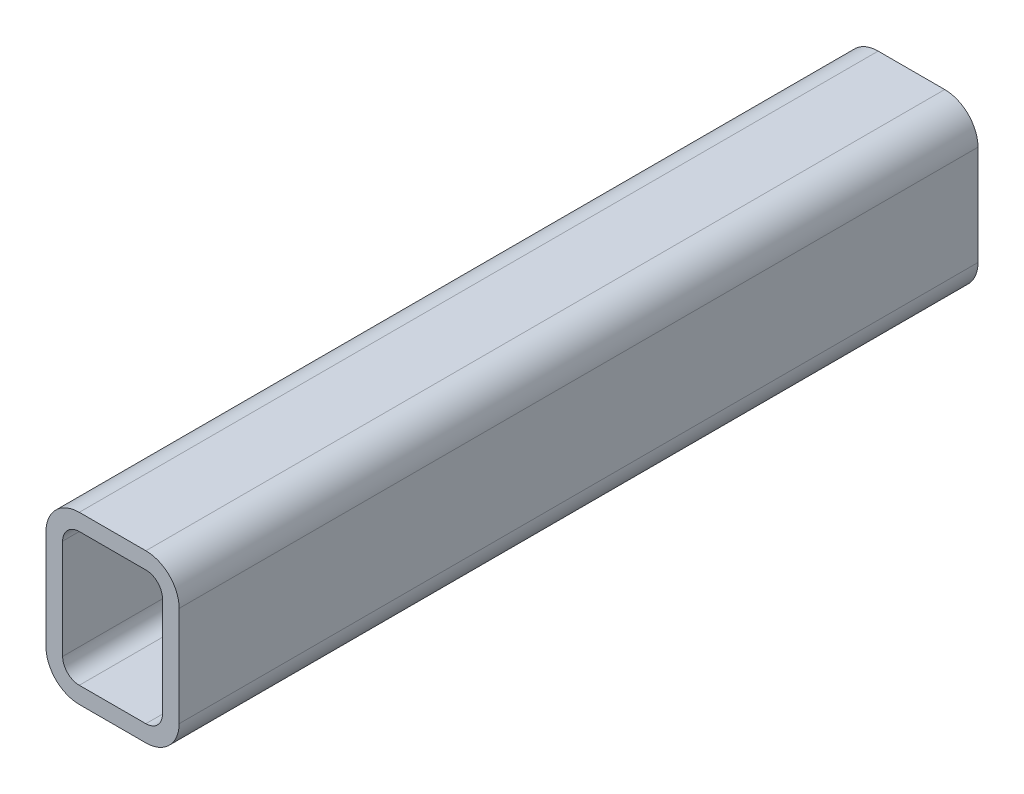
ISO-10303-21;
HEADER;
FILE_DESCRIPTION(('STEP AP214'),'2;1');
FILE_NAME('part.step','',(''),(''),'','','');
FILE_SCHEMA(('AUTOMOTIVE_DESIGN { 1 0 10303 214 1 1 1 1 }'));
ENDSEC;
DATA;
#1=APPLICATION_CONTEXT('core data for automotive mechanical design processes');
#2=APPLICATION_PROTOCOL_DEFINITION('international standard','automotive_design',2000,#1);
#3=PRODUCT_CONTEXT('',#1,'mechanical');
#4=PRODUCT('Part','Part','',(#3));
#5=PRODUCT_RELATED_PRODUCT_CATEGORY('part','',(#4));
#6=PRODUCT_DEFINITION_FORMATION('','',#4);
#7=PRODUCT_DEFINITION_CONTEXT('part definition',#1,'design');
#8=PRODUCT_DEFINITION('design','',#6,#7);
#9=PRODUCT_DEFINITION_SHAPE('','',#8);
#10=(LENGTH_UNIT() NAMED_UNIT(*) SI_UNIT(.MILLI.,.METRE.));
#11=(NAMED_UNIT(*) PLANE_ANGLE_UNIT() SI_UNIT($,.RADIAN.));
#12=(NAMED_UNIT(*) SI_UNIT($,.STERADIAN.) SOLID_ANGLE_UNIT());
#13=UNCERTAINTY_MEASURE_WITH_UNIT(LENGTH_MEASURE(1.E-05),#10,'distance_accuracy_value','');
#14=(GEOMETRIC_REPRESENTATION_CONTEXT(3) GLOBAL_UNCERTAINTY_ASSIGNED_CONTEXT((#13)) GLOBAL_UNIT_ASSIGNED_CONTEXT((#10,
#11,#12)) REPRESENTATION_CONTEXT('',''));
#15=CARTESIAN_POINT('',(0.,0.,0.));
#16=DIRECTION('',(0.,0.,1.));
#17=DIRECTION('',(1.,0.,0.));
#18=AXIS2_PLACEMENT_3D('',#15,#16,#17);
#19=CARTESIAN_POINT('',(12.7,50.8,304.8));
#20=DIRECTION('',(0.,0.,1.));
#21=DIRECTION('',(1.,0.,0.));
#22=AXIS2_PLACEMENT_3D('',#19,#20,#21);
#23=PLANE('',#22);
#24=CARTESIAN_POINT('',(12.7,50.8,304.8));
#25=DIRECTION('',(0.,0.,1.));
#26=DIRECTION('',(1.,0.,0.));
#27=AXIS2_PLACEMENT_3D('',#24,#25,#26);
#28=CIRCLE('',#27,12.7);
#29=CARTESIAN_POINT('',(12.7,63.5,304.8));
#30=VERTEX_POINT('',#29);
#31=CARTESIAN_POINT('',(0.,50.8,304.8));
#32=VERTEX_POINT('',#31);
#33=EDGE_CURVE('E211',#30,#32,#28,.T.);
#34=ORIENTED_EDGE('',*,*,#33,.T.);
#35=DIRECTION('',(0.,-1.,0.));
#36=VECTOR('',#35,1.);
#37=CARTESIAN_POINT('',(0.,12.7,304.8));
#38=LINE('',#37,#36);
#39=CARTESIAN_POINT('',(0.,12.7,304.8));
#40=VERTEX_POINT('',#39);
#41=EDGE_CURVE('E214',#32,#40,#38,.T.);
#42=ORIENTED_EDGE('',*,*,#41,.T.);
#43=CARTESIAN_POINT('',(12.7,12.7,304.8));
#44=DIRECTION('',(0.,0.,1.));
#45=DIRECTION('',(1.,0.,0.));
#46=AXIS2_PLACEMENT_3D('',#43,#44,#45);
#47=CIRCLE('',#46,12.7);
#48=CARTESIAN_POINT('',(12.7,0.,304.8));
#49=VERTEX_POINT('',#48);
#50=EDGE_CURVE('E217',#40,#49,#47,.T.);
#51=ORIENTED_EDGE('',*,*,#50,.T.);
#52=DIRECTION('',(1.,0.,0.));
#53=VECTOR('',#52,1.);
#54=CARTESIAN_POINT('',(38.1,0.,304.8));
#55=LINE('',#54,#53);
#56=CARTESIAN_POINT('',(38.1,0.,304.8));
#57=VERTEX_POINT('',#56);
#58=EDGE_CURVE('E219',#49,#57,#55,.T.);
#59=ORIENTED_EDGE('',*,*,#58,.T.);
#60=CARTESIAN_POINT('',(38.1,12.7,304.8));
#61=DIRECTION('',(0.,0.,1.));
#62=DIRECTION('',(1.,0.,0.));
#63=AXIS2_PLACEMENT_3D('',#60,#61,#62);
#64=CIRCLE('',#63,12.7);
#65=CARTESIAN_POINT('',(50.8,12.7,304.8));
#66=VERTEX_POINT('',#65);
#67=EDGE_CURVE('E221',#57,#66,#64,.T.);
#68=ORIENTED_EDGE('',*,*,#67,.T.);
#69=DIRECTION('',(0.,1.,0.));
#70=VECTOR('',#69,1.);
#71=CARTESIAN_POINT('',(50.8,50.8,304.8));
#72=LINE('',#71,#70);
#73=CARTESIAN_POINT('',(50.8,50.8,304.8));
#74=VERTEX_POINT('',#73);
#75=EDGE_CURVE('E223',#66,#74,#72,.T.);
#76=ORIENTED_EDGE('',*,*,#75,.T.);
#77=CARTESIAN_POINT('',(38.1,50.8,304.8));
#78=DIRECTION('',(0.,0.,1.));
#79=DIRECTION('',(1.,0.,0.));
#80=AXIS2_PLACEMENT_3D('',#77,#78,#79);
#81=CIRCLE('',#80,12.7);
#82=CARTESIAN_POINT('',(38.1,63.5,304.8));
#83=VERTEX_POINT('',#82);
#84=EDGE_CURVE('E225',#74,#83,#81,.T.);
#85=ORIENTED_EDGE('',*,*,#84,.T.);
#86=DIRECTION('',(-1.,0.,0.));
#87=VECTOR('',#86,1.);
#88=CARTESIAN_POINT('',(12.7,63.5,304.8));
#89=LINE('',#88,#87);
#90=EDGE_CURVE('E227',#83,#30,#89,.T.);
#91=ORIENTED_EDGE('',*,*,#90,.T.);
#92=EDGE_LOOP('',(#34,#42,#51,#59,#68,#76,#85,#91));
#93=FACE_BOUND('',#92,.T.);
#94=DIRECTION('',(0.,-1.,0.));
#95=VECTOR('',#94,1.);
#96=CARTESIAN_POINT('',(6.35,12.7,304.8));
#97=LINE('',#96,#95);
#98=CARTESIAN_POINT('',(6.35,50.8,304.8));
#99=VERTEX_POINT('',#98);
#100=CARTESIAN_POINT('',(6.35,12.7,304.8));
#101=VERTEX_POINT('',#100);
#102=EDGE_CURVE('E154',#99,#101,#97,.T.);
#103=ORIENTED_EDGE('',*,*,#102,.F.);
#104=CARTESIAN_POINT('',(12.7,50.8,304.8));
#105=DIRECTION('',(0.,0.,1.));
#106=DIRECTION('',(1.,0.,0.));
#107=AXIS2_PLACEMENT_3D('',#104,#105,#106);
#108=CIRCLE('',#107,6.35);
#109=CARTESIAN_POINT('',(12.7,57.15,304.8));
#110=VERTEX_POINT('',#109);
#111=EDGE_CURVE('E146',#110,#99,#108,.T.);
#112=ORIENTED_EDGE('',*,*,#111,.F.);
#113=DIRECTION('',(-1.,0.,0.));
#114=VECTOR('',#113,1.);
#115=CARTESIAN_POINT('',(12.7,57.15,304.8));
#116=LINE('',#115,#114);
#117=CARTESIAN_POINT('',(38.1,57.15,304.8));
#118=VERTEX_POINT('',#117);
#119=EDGE_CURVE('E179',#118,#110,#116,.T.);
#120=ORIENTED_EDGE('',*,*,#119,.F.);
#121=CARTESIAN_POINT('',(38.1,50.8,304.8));
#122=DIRECTION('',(0.,0.,1.));
#123=DIRECTION('',(1.,0.,0.));
#124=AXIS2_PLACEMENT_3D('',#121,#122,#123);
#125=CIRCLE('',#124,6.35);
#126=CARTESIAN_POINT('',(44.45,50.8,304.8));
#127=VERTEX_POINT('',#126);
#128=EDGE_CURVE('E177',#127,#118,#125,.T.);
#129=ORIENTED_EDGE('',*,*,#128,.F.);
#130=DIRECTION('',(0.,1.,0.));
#131=VECTOR('',#130,1.);
#132=CARTESIAN_POINT('',(44.45,50.8,304.8));
#133=LINE('',#132,#131);
#134=CARTESIAN_POINT('',(44.45,12.7,304.8));
#135=VERTEX_POINT('',#134);
#136=EDGE_CURVE('E175',#135,#127,#133,.T.);
#137=ORIENTED_EDGE('',*,*,#136,.F.);
#138=CARTESIAN_POINT('',(38.1,12.7,304.8));
#139=DIRECTION('',(0.,0.,1.));
#140=DIRECTION('',(1.,0.,0.));
#141=AXIS2_PLACEMENT_3D('',#138,#139,#140);
#142=CIRCLE('',#141,6.35);
#143=CARTESIAN_POINT('',(38.1,6.35,304.8));
#144=VERTEX_POINT('',#143);
#145=EDGE_CURVE('E173',#144,#135,#142,.T.);
#146=ORIENTED_EDGE('',*,*,#145,.F.);
#147=DIRECTION('',(1.,0.,0.));
#148=VECTOR('',#147,1.);
#149=CARTESIAN_POINT('',(38.1,6.35,304.8));
#150=LINE('',#149,#148);
#151=CARTESIAN_POINT('',(12.7,6.35,304.8));
#152=VERTEX_POINT('',#151);
#153=EDGE_CURVE('E169',#152,#144,#150,.T.);
#154=ORIENTED_EDGE('',*,*,#153,.F.);
#155=CARTESIAN_POINT('',(12.7,12.7,304.8));
#156=DIRECTION('',(0.,0.,1.));
#157=DIRECTION('',(1.,0.,0.));
#158=AXIS2_PLACEMENT_3D('',#155,#156,#157);
#159=CIRCLE('',#158,6.35);
#160=EDGE_CURVE('E167',#101,#152,#159,.T.);
#161=ORIENTED_EDGE('',*,*,#160,.F.);
#162=EDGE_LOOP('',(#103,#112,#120,#129,#137,#146,#154,#161));
#163=FACE_BOUND('',#162,.T.);
#164=ADVANCED_FACE('F33',(#93,#163),#23,.T.);
#165=CARTESIAN_POINT('',(12.7,50.8,0.));
#166=DIRECTION('',(0.,0.,1.));
#167=DIRECTION('',(1.,0.,0.));
#168=AXIS2_PLACEMENT_3D('',#165,#166,#167);
#169=PLANE('',#168);
#170=CARTESIAN_POINT('',(12.7,50.8,0.));
#171=DIRECTION('',(0.,0.,1.));
#172=DIRECTION('',(1.,0.,0.));
#173=AXIS2_PLACEMENT_3D('',#170,#171,#172);
#174=CIRCLE('',#173,12.7);
#175=CARTESIAN_POINT('',(12.7,63.5,0.));
#176=VERTEX_POINT('',#175);
#177=CARTESIAN_POINT('',(0.,50.8,0.));
#178=VERTEX_POINT('',#177);
#179=EDGE_CURVE('E162',#176,#178,#174,.T.);
#180=ORIENTED_EDGE('',*,*,#179,.F.);
#181=DIRECTION('',(-1.,0.,0.));
#182=VECTOR('',#181,1.);
#183=CARTESIAN_POINT('',(12.7,63.5,0.));
#184=LINE('',#183,#182);
#185=CARTESIAN_POINT('',(38.1,63.5,0.));
#186=VERTEX_POINT('',#185);
#187=EDGE_CURVE('E215',#186,#176,#184,.T.);
#188=ORIENTED_EDGE('',*,*,#187,.F.);
#189=CARTESIAN_POINT('',(38.1,50.8,0.));
#190=DIRECTION('',(0.,0.,1.));
#191=DIRECTION('',(1.,0.,0.));
#192=AXIS2_PLACEMENT_3D('',#189,#190,#191);
#193=CIRCLE('',#192,12.7);
#194=CARTESIAN_POINT('',(50.8,50.8,0.));
#195=VERTEX_POINT('',#194);
#196=EDGE_CURVE('E242',#195,#186,#193,.T.);
#197=ORIENTED_EDGE('',*,*,#196,.F.);
#198=DIRECTION('',(0.,1.,0.));
#199=VECTOR('',#198,1.);
#200=CARTESIAN_POINT('',(50.8,50.8,0.));
#201=LINE('',#200,#199);
#202=CARTESIAN_POINT('',(50.8,12.7,0.));
#203=VERTEX_POINT('',#202);
#204=EDGE_CURVE('E240',#203,#195,#201,.T.);
#205=ORIENTED_EDGE('',*,*,#204,.F.);
#206=CARTESIAN_POINT('',(38.1,12.7,0.));
#207=DIRECTION('',(0.,0.,1.));
#208=DIRECTION('',(1.,0.,0.));
#209=AXIS2_PLACEMENT_3D('',#206,#207,#208);
#210=CIRCLE('',#209,12.7);
#211=CARTESIAN_POINT('',(38.1,0.,0.));
#212=VERTEX_POINT('',#211);
#213=EDGE_CURVE('E238',#212,#203,#210,.T.);
#214=ORIENTED_EDGE('',*,*,#213,.F.);
#215=DIRECTION('',(1.,0.,0.));
#216=VECTOR('',#215,1.);
#217=CARTESIAN_POINT('',(38.1,0.,0.));
#218=LINE('',#217,#216);
#219=CARTESIAN_POINT('',(12.7,0.,0.));
#220=VERTEX_POINT('',#219);
#221=EDGE_CURVE('E236',#220,#212,#218,.T.);
#222=ORIENTED_EDGE('',*,*,#221,.F.);
#223=CARTESIAN_POINT('',(12.7,12.7,0.));
#224=DIRECTION('',(0.,0.,1.));
#225=DIRECTION('',(1.,0.,0.));
#226=AXIS2_PLACEMENT_3D('',#223,#224,#225);
#227=CIRCLE('',#226,12.7);
#228=CARTESIAN_POINT('',(0.,12.7,0.));
#229=VERTEX_POINT('',#228);
#230=EDGE_CURVE('E234',#229,#220,#227,.T.);
#231=ORIENTED_EDGE('',*,*,#230,.F.);
#232=DIRECTION('',(0.,-1.,0.));
#233=VECTOR('',#232,1.);
#234=CARTESIAN_POINT('',(0.,12.7,0.));
#235=LINE('',#234,#233);
#236=EDGE_CURVE('E232',#178,#229,#235,.T.);
#237=ORIENTED_EDGE('',*,*,#236,.F.);
#238=EDGE_LOOP('',(#180,#188,#197,#205,#214,#222,#231,#237));
#239=FACE_BOUND('',#238,.T.);
#240=CARTESIAN_POINT('',(12.7,50.8,0.));
#241=DIRECTION('',(0.,0.,1.));
#242=DIRECTION('',(1.,0.,0.));
#243=AXIS2_PLACEMENT_3D('',#240,#241,#242);
#244=CIRCLE('',#243,6.35);
#245=CARTESIAN_POINT('',(12.7,57.15,0.));
#246=VERTEX_POINT('',#245);
#247=CARTESIAN_POINT('',(6.35,50.8,0.));
#248=VERTEX_POINT('',#247);
#249=EDGE_CURVE('E56',#246,#248,#244,.T.);
#250=ORIENTED_EDGE('',*,*,#249,.T.);
#251=DIRECTION('',(0.,-1.,0.));
#252=VECTOR('',#251,1.);
#253=CARTESIAN_POINT('',(6.35,12.7,0.));
#254=LINE('',#253,#252);
#255=CARTESIAN_POINT('',(6.35,12.7,0.));
#256=VERTEX_POINT('',#255);
#257=EDGE_CURVE('E161',#248,#256,#254,.T.);
#258=ORIENTED_EDGE('',*,*,#257,.T.);
#259=CARTESIAN_POINT('',(12.7,12.7,0.));
#260=DIRECTION('',(0.,0.,1.));
#261=DIRECTION('',(1.,0.,0.));
#262=AXIS2_PLACEMENT_3D('',#259,#260,#261);
#263=CIRCLE('',#262,6.35);
#264=CARTESIAN_POINT('',(12.7,6.35,0.));
#265=VERTEX_POINT('',#264);
#266=EDGE_CURVE('E183',#256,#265,#263,.T.);
#267=ORIENTED_EDGE('',*,*,#266,.T.);
#268=DIRECTION('',(1.,0.,0.));
#269=VECTOR('',#268,1.);
#270=CARTESIAN_POINT('',(38.1,6.35,0.));
#271=LINE('',#270,#269);
#272=CARTESIAN_POINT('',(38.1,6.35,0.));
#273=VERTEX_POINT('',#272);
#274=EDGE_CURVE('E186',#265,#273,#271,.T.);
#275=ORIENTED_EDGE('',*,*,#274,.T.);
#276=CARTESIAN_POINT('',(38.1,12.7,0.));
#277=DIRECTION('',(0.,0.,1.));
#278=DIRECTION('',(1.,0.,0.));
#279=AXIS2_PLACEMENT_3D('',#276,#277,#278);
#280=CIRCLE('',#279,6.35);
#281=CARTESIAN_POINT('',(44.45,12.7,0.));
#282=VERTEX_POINT('',#281);
#283=EDGE_CURVE('E189',#273,#282,#280,.T.);
#284=ORIENTED_EDGE('',*,*,#283,.T.);
#285=DIRECTION('',(0.,1.,0.));
#286=VECTOR('',#285,1.);
#287=CARTESIAN_POINT('',(44.45,50.8,0.));
#288=LINE('',#287,#286);
#289=CARTESIAN_POINT('',(44.45,50.8,0.));
#290=VERTEX_POINT('',#289);
#291=EDGE_CURVE('E192',#282,#290,#288,.T.);
#292=ORIENTED_EDGE('',*,*,#291,.T.);
#293=CARTESIAN_POINT('',(38.1,50.8,0.));
#294=DIRECTION('',(0.,0.,1.));
#295=DIRECTION('',(1.,0.,0.));
#296=AXIS2_PLACEMENT_3D('',#293,#294,#295);
#297=CIRCLE('',#296,6.35);
#298=CARTESIAN_POINT('',(38.1,57.15,0.));
#299=VERTEX_POINT('',#298);
#300=EDGE_CURVE('E195',#290,#299,#297,.T.);
#301=ORIENTED_EDGE('',*,*,#300,.T.);
#302=DIRECTION('',(-1.,0.,0.));
#303=VECTOR('',#302,1.);
#304=CARTESIAN_POINT('',(12.7,57.15,0.));
#305=LINE('',#304,#303);
#306=EDGE_CURVE('E155',#299,#246,#305,.T.);
#307=ORIENTED_EDGE('',*,*,#306,.T.);
#308=EDGE_LOOP('',(#250,#258,#267,#275,#284,#292,#301,#307));
#309=FACE_BOUND('',#308,.T.);
#310=ADVANCED_FACE('F272',(#239,#309),#169,.F.);
#311=CARTESIAN_POINT('',(12.7,50.8,304.8));
#312=DIRECTION('',(0.,0.,-1.));
#313=DIRECTION('',(-1.,0.,0.));
#314=AXIS2_PLACEMENT_3D('',#311,#312,#313);
#315=CYLINDRICAL_SURFACE('',#314,12.7);
#316=ORIENTED_EDGE('',*,*,#179,.T.);
#317=DIRECTION('',(0.,0.,-1.));
#318=VECTOR('',#317,1.);
#319=CARTESIAN_POINT('',(0.,50.8,304.8));
#320=LINE('',#319,#318);
#321=EDGE_CURVE('E11',#32,#178,#320,.T.);
#322=ORIENTED_EDGE('',*,*,#321,.F.);
#323=ORIENTED_EDGE('',*,*,#33,.F.);
#324=DIRECTION('',(0.,0.,-1.));
#325=VECTOR('',#324,1.);
#326=CARTESIAN_POINT('',(12.7,63.5,304.8));
#327=LINE('',#326,#325);
#328=EDGE_CURVE('E229',#30,#176,#327,.T.);
#329=ORIENTED_EDGE('',*,*,#328,.T.);
#330=EDGE_LOOP('',(#316,#322,#323,#329));
#331=FACE_BOUND('',#330,.T.);
#332=ADVANCED_FACE('F35',(#331),#315,.T.);
#333=CARTESIAN_POINT('',(0.,12.7,304.8));
#334=DIRECTION('',(1.,0.,0.));
#335=DIRECTION('',(0.,0.,-1.));
#336=AXIS2_PLACEMENT_3D('',#333,#334,#335);
#337=PLANE('',#336);
#338=ORIENTED_EDGE('',*,*,#236,.T.);
#339=DIRECTION('',(0.,0.,-1.));
#340=VECTOR('',#339,1.);
#341=CARTESIAN_POINT('',(0.,12.7,304.8));
#342=LINE('',#341,#340);
#343=EDGE_CURVE('E41',#40,#229,#342,.T.);
#344=ORIENTED_EDGE('',*,*,#343,.F.);
#345=ORIENTED_EDGE('',*,*,#41,.F.);
#346=ORIENTED_EDGE('',*,*,#321,.T.);
#347=EDGE_LOOP('',(#338,#344,#345,#346));
#348=FACE_BOUND('',#347,.T.);
#349=ADVANCED_FACE('F289',(#348),#337,.F.);
#350=CARTESIAN_POINT('',(12.7,12.7,304.8));
#351=DIRECTION('',(0.,0.,-1.));
#352=DIRECTION('',(-1.,0.,0.));
#353=AXIS2_PLACEMENT_3D('',#350,#351,#352);
#354=CYLINDRICAL_SURFACE('',#353,12.7);
#355=ORIENTED_EDGE('',*,*,#230,.T.);
#356=DIRECTION('',(0.,0.,-1.));
#357=VECTOR('',#356,1.);
#358=CARTESIAN_POINT('',(12.7,0.,304.8));
#359=LINE('',#358,#357);
#360=EDGE_CURVE('E259',#49,#220,#359,.T.);
#361=ORIENTED_EDGE('',*,*,#360,.F.);
#362=ORIENTED_EDGE('',*,*,#50,.F.);
#363=ORIENTED_EDGE('',*,*,#343,.T.);
#364=EDGE_LOOP('',(#355,#361,#362,#363));
#365=FACE_BOUND('',#364,.T.);
#366=ADVANCED_FACE('F266',(#365),#354,.T.);
#367=CARTESIAN_POINT('',(38.1,0.,304.8));
#368=DIRECTION('',(0.,1.,0.));
#369=DIRECTION('',(0.,0.,1.));
#370=AXIS2_PLACEMENT_3D('',#367,#368,#369);
#371=PLANE('',#370);
#372=ORIENTED_EDGE('',*,*,#221,.T.);
#373=DIRECTION('',(0.,0.,-1.));
#374=VECTOR('',#373,1.);
#375=CARTESIAN_POINT('',(38.1,0.,304.8));
#376=LINE('',#375,#374);
#377=EDGE_CURVE('E256',#57,#212,#376,.T.);
#378=ORIENTED_EDGE('',*,*,#377,.F.);
#379=ORIENTED_EDGE('',*,*,#58,.F.);
#380=ORIENTED_EDGE('',*,*,#360,.T.);
#381=EDGE_LOOP('',(#372,#378,#379,#380));
#382=FACE_BOUND('',#381,.T.);
#383=ADVANCED_FACE('F278',(#382),#371,.F.);
#384=CARTESIAN_POINT('',(38.1,12.7,304.8));
#385=DIRECTION('',(0.,0.,-1.));
#386=DIRECTION('',(-1.,0.,0.));
#387=AXIS2_PLACEMENT_3D('',#384,#385,#386);
#388=CYLINDRICAL_SURFACE('',#387,12.7);
#389=ORIENTED_EDGE('',*,*,#213,.T.);
#390=DIRECTION('',(0.,0.,-1.));
#391=VECTOR('',#390,1.);
#392=CARTESIAN_POINT('',(50.8,12.7,304.8));
#393=LINE('',#392,#391);
#394=EDGE_CURVE('E253',#66,#203,#393,.T.);
#395=ORIENTED_EDGE('',*,*,#394,.F.);
#396=ORIENTED_EDGE('',*,*,#67,.F.);
#397=ORIENTED_EDGE('',*,*,#377,.T.);
#398=EDGE_LOOP('',(#389,#395,#396,#397));
#399=FACE_BOUND('',#398,.T.);
#400=ADVANCED_FACE('F282',(#399),#388,.T.);
#401=CARTESIAN_POINT('',(50.8,50.8,304.8));
#402=DIRECTION('',(-1.,0.,0.));
#403=DIRECTION('',(0.,0.,1.));
#404=AXIS2_PLACEMENT_3D('',#401,#402,#403);
#405=PLANE('',#404);
#406=ORIENTED_EDGE('',*,*,#204,.T.);
#407=DIRECTION('',(0.,0.,-1.));
#408=VECTOR('',#407,1.);
#409=CARTESIAN_POINT('',(50.8,50.8,304.8));
#410=LINE('',#409,#408);
#411=EDGE_CURVE('E250',#74,#195,#410,.T.);
#412=ORIENTED_EDGE('',*,*,#411,.F.);
#413=ORIENTED_EDGE('',*,*,#75,.F.);
#414=ORIENTED_EDGE('',*,*,#394,.T.);
#415=EDGE_LOOP('',(#406,#412,#413,#414));
#416=FACE_BOUND('',#415,.T.);
#417=ADVANCED_FACE('F302',(#416),#405,.F.);
#418=CARTESIAN_POINT('',(38.1,50.8,304.8));
#419=DIRECTION('',(0.,0.,-1.));
#420=DIRECTION('',(-1.,0.,0.));
#421=AXIS2_PLACEMENT_3D('',#418,#419,#420);
#422=CYLINDRICAL_SURFACE('',#421,12.7);
#423=ORIENTED_EDGE('',*,*,#196,.T.);
#424=DIRECTION('',(0.,0.,-1.));
#425=VECTOR('',#424,1.);
#426=CARTESIAN_POINT('',(38.1,63.5,304.8));
#427=LINE('',#426,#425);
#428=EDGE_CURVE('E247',#83,#186,#427,.T.);
#429=ORIENTED_EDGE('',*,*,#428,.F.);
#430=ORIENTED_EDGE('',*,*,#84,.F.);
#431=ORIENTED_EDGE('',*,*,#411,.T.);
#432=EDGE_LOOP('',(#423,#429,#430,#431));
#433=FACE_BOUND('',#432,.T.);
#434=ADVANCED_FACE('F300',(#433),#422,.T.);
#435=CARTESIAN_POINT('',(12.7,63.5,304.8));
#436=DIRECTION('',(0.,-1.,0.));
#437=DIRECTION('',(0.,0.,-1.));
#438=AXIS2_PLACEMENT_3D('',#435,#436,#437);
#439=PLANE('',#438);
#440=ORIENTED_EDGE('',*,*,#187,.T.);
#441=ORIENTED_EDGE('',*,*,#328,.F.);
#442=ORIENTED_EDGE('',*,*,#90,.F.);
#443=ORIENTED_EDGE('',*,*,#428,.T.);
#444=EDGE_LOOP('',(#440,#441,#442,#443));
#445=FACE_BOUND('',#444,.T.);
#446=ADVANCED_FACE('F295',(#445),#439,.F.);
#447=CARTESIAN_POINT('',(12.7,50.8,304.8));
#448=DIRECTION('',(0.,0.,-1.));
#449=DIRECTION('',(-1.,0.,0.));
#450=AXIS2_PLACEMENT_3D('',#447,#448,#449);
#451=CYLINDRICAL_SURFACE('',#450,6.35);
#452=ORIENTED_EDGE('',*,*,#249,.F.);
#453=DIRECTION('',(0.,0.,-1.));
#454=VECTOR('',#453,1.);
#455=CARTESIAN_POINT('',(12.7,57.15,304.8));
#456=LINE('',#455,#454);
#457=EDGE_CURVE('E150',#110,#246,#456,.T.);
#458=ORIENTED_EDGE('',*,*,#457,.F.);
#459=ORIENTED_EDGE('',*,*,#111,.T.);
#460=DIRECTION('',(0.,0.,-1.));
#461=VECTOR('',#460,1.);
#462=CARTESIAN_POINT('',(6.35,50.8,304.8));
#463=LINE('',#462,#461);
#464=EDGE_CURVE('E149',#99,#248,#463,.T.);
#465=ORIENTED_EDGE('',*,*,#464,.T.);
#466=EDGE_LOOP('',(#452,#458,#459,#465));
#467=FACE_BOUND('',#466,.T.);
#468=ADVANCED_FACE('F148',(#467),#451,.F.);
#469=CARTESIAN_POINT('',(6.35,12.7,304.8));
#470=DIRECTION('',(1.,0.,0.));
#471=DIRECTION('',(0.,0.,-1.));
#472=AXIS2_PLACEMENT_3D('',#469,#470,#471);
#473=PLANE('',#472);
#474=ORIENTED_EDGE('',*,*,#257,.F.);
#475=ORIENTED_EDGE('',*,*,#464,.F.);
#476=ORIENTED_EDGE('',*,*,#102,.T.);
#477=DIRECTION('',(0.,0.,-1.));
#478=VECTOR('',#477,1.);
#479=CARTESIAN_POINT('',(6.35,12.7,304.8));
#480=LINE('',#479,#478);
#481=EDGE_CURVE('E163',#101,#256,#480,.T.);
#482=ORIENTED_EDGE('',*,*,#481,.T.);
#483=EDGE_LOOP('',(#474,#475,#476,#482));
#484=FACE_BOUND('',#483,.T.);
#485=ADVANCED_FACE('F158',(#484),#473,.T.);
#486=CARTESIAN_POINT('',(12.7,12.7,304.8));
#487=DIRECTION('',(0.,0.,-1.));
#488=DIRECTION('',(-1.,0.,0.));
#489=AXIS2_PLACEMENT_3D('',#486,#487,#488);
#490=CYLINDRICAL_SURFACE('',#489,6.35);
#491=ORIENTED_EDGE('',*,*,#266,.F.);
#492=ORIENTED_EDGE('',*,*,#481,.F.);
#493=ORIENTED_EDGE('',*,*,#160,.T.);
#494=DIRECTION('',(0.,0.,-1.));
#495=VECTOR('',#494,1.);
#496=CARTESIAN_POINT('',(12.7,6.35,304.8));
#497=LINE('',#496,#495);
#498=EDGE_CURVE('E208',#152,#265,#497,.T.);
#499=ORIENTED_EDGE('',*,*,#498,.T.);
#500=EDGE_LOOP('',(#491,#492,#493,#499));
#501=FACE_BOUND('',#500,.T.);
#502=ADVANCED_FACE('F327',(#501),#490,.F.);
#503=CARTESIAN_POINT('',(38.1,6.35,304.8));
#504=DIRECTION('',(0.,1.,0.));
#505=DIRECTION('',(0.,0.,1.));
#506=AXIS2_PLACEMENT_3D('',#503,#504,#505);
#507=PLANE('',#506);
#508=ORIENTED_EDGE('',*,*,#274,.F.);
#509=ORIENTED_EDGE('',*,*,#498,.F.);
#510=ORIENTED_EDGE('',*,*,#153,.T.);
#511=DIRECTION('',(0.,0.,-1.));
#512=VECTOR('',#511,1.);
#513=CARTESIAN_POINT('',(38.1,6.35,304.8));
#514=LINE('',#513,#512);
#515=EDGE_CURVE('E206',#144,#273,#514,.T.);
#516=ORIENTED_EDGE('',*,*,#515,.T.);
#517=EDGE_LOOP('',(#508,#509,#510,#516));
#518=FACE_BOUND('',#517,.T.);
#519=ADVANCED_FACE('F331',(#518),#507,.T.);
#520=CARTESIAN_POINT('',(38.1,12.7,304.8));
#521=DIRECTION('',(0.,0.,-1.));
#522=DIRECTION('',(-1.,0.,0.));
#523=AXIS2_PLACEMENT_3D('',#520,#521,#522);
#524=CYLINDRICAL_SURFACE('',#523,6.35);
#525=ORIENTED_EDGE('',*,*,#283,.F.);
#526=ORIENTED_EDGE('',*,*,#515,.F.);
#527=ORIENTED_EDGE('',*,*,#145,.T.);
#528=DIRECTION('',(0.,0.,-1.));
#529=VECTOR('',#528,1.);
#530=CARTESIAN_POINT('',(44.45,12.7,304.8));
#531=LINE('',#530,#529);
#532=EDGE_CURVE('E204',#135,#282,#531,.T.);
#533=ORIENTED_EDGE('',*,*,#532,.T.);
#534=EDGE_LOOP('',(#525,#526,#527,#533));
#535=FACE_BOUND('',#534,.T.);
#536=ADVANCED_FACE('F337',(#535),#524,.F.);
#537=CARTESIAN_POINT('',(44.45,50.8,304.8));
#538=DIRECTION('',(-1.,0.,0.));
#539=DIRECTION('',(0.,0.,1.));
#540=AXIS2_PLACEMENT_3D('',#537,#538,#539);
#541=PLANE('',#540);
#542=ORIENTED_EDGE('',*,*,#291,.F.);
#543=ORIENTED_EDGE('',*,*,#532,.F.);
#544=ORIENTED_EDGE('',*,*,#136,.T.);
#545=DIRECTION('',(0.,0.,-1.));
#546=VECTOR('',#545,1.);
#547=CARTESIAN_POINT('',(44.45,50.8,304.8));
#548=LINE('',#547,#546);
#549=EDGE_CURVE('E202',#127,#290,#548,.T.);
#550=ORIENTED_EDGE('',*,*,#549,.T.);
#551=EDGE_LOOP('',(#542,#543,#544,#550));
#552=FACE_BOUND('',#551,.T.);
#553=ADVANCED_FACE('F341',(#552),#541,.T.);
#554=CARTESIAN_POINT('',(38.1,50.8,304.8));
#555=DIRECTION('',(0.,0.,-1.));
#556=DIRECTION('',(-1.,0.,0.));
#557=AXIS2_PLACEMENT_3D('',#554,#555,#556);
#558=CYLINDRICAL_SURFACE('',#557,6.35);
#559=ORIENTED_EDGE('',*,*,#300,.F.);
#560=ORIENTED_EDGE('',*,*,#549,.F.);
#561=ORIENTED_EDGE('',*,*,#128,.T.);
#562=DIRECTION('',(0.,0.,-1.));
#563=VECTOR('',#562,1.);
#564=CARTESIAN_POINT('',(38.1,57.15,304.8));
#565=LINE('',#564,#563);
#566=EDGE_CURVE('E48',#118,#299,#565,.T.);
#567=ORIENTED_EDGE('',*,*,#566,.T.);
#568=EDGE_LOOP('',(#559,#560,#561,#567));
#569=FACE_BOUND('',#568,.T.);
#570=ADVANCED_FACE('F345',(#569),#558,.F.);
#571=CARTESIAN_POINT('',(12.7,57.15,304.8));
#572=DIRECTION('',(0.,-1.,0.));
#573=DIRECTION('',(0.,0.,-1.));
#574=AXIS2_PLACEMENT_3D('',#571,#572,#573);
#575=PLANE('',#574);
#576=ORIENTED_EDGE('',*,*,#306,.F.);
#577=ORIENTED_EDGE('',*,*,#566,.F.);
#578=ORIENTED_EDGE('',*,*,#119,.T.);
#579=ORIENTED_EDGE('',*,*,#457,.T.);
#580=EDGE_LOOP('',(#576,#577,#578,#579));
#581=FACE_BOUND('',#580,.T.);
#582=ADVANCED_FACE('F349',(#581),#575,.T.);
#583=CLOSED_SHELL('',(#164,#310,#332,#349,#366,#383,#400,#417,#434,#446,#468,#485,#502,#519,
#536,#553,#570,#582));
#584=MANIFOLD_SOLID_BREP('B2',#583);
#585=ADVANCED_BREP_SHAPE_REPRESENTATION('',(#18,#584),#14);
#586=SHAPE_DEFINITION_REPRESENTATION(#9,#585);
ENDSEC;
END-ISO-10303-21;
